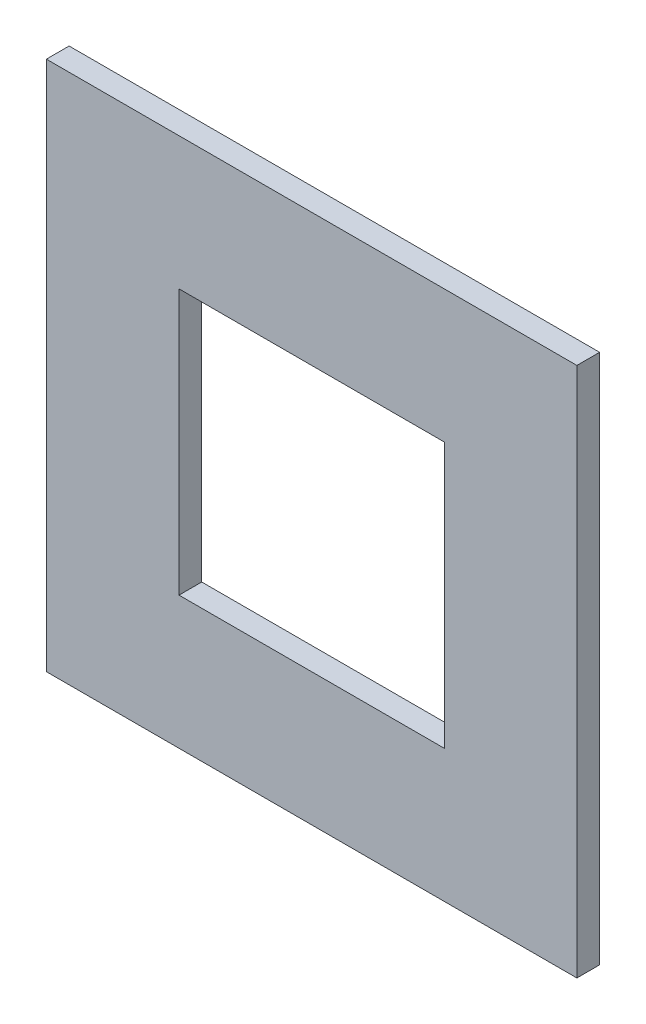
ISO-10303-21;
HEADER;
FILE_DESCRIPTION(('STEP AP214'),'2;1');
FILE_NAME('part.step','',(''),(''),'','','');
FILE_SCHEMA(('AUTOMOTIVE_DESIGN { 1 0 10303 214 1 1 1 1 }'));
ENDSEC;
DATA;
#1=APPLICATION_CONTEXT('core data for automotive mechanical design processes');
#2=APPLICATION_PROTOCOL_DEFINITION('international standard','automotive_design',2000,#1);
#3=PRODUCT_CONTEXT('',#1,'mechanical');
#4=PRODUCT('Part','Part','',(#3));
#5=PRODUCT_RELATED_PRODUCT_CATEGORY('part','',(#4));
#6=PRODUCT_DEFINITION_FORMATION('','',#4);
#7=PRODUCT_DEFINITION_CONTEXT('part definition',#1,'design');
#8=PRODUCT_DEFINITION('design','',#6,#7);
#9=PRODUCT_DEFINITION_SHAPE('','',#8);
#10=(LENGTH_UNIT() NAMED_UNIT(*) SI_UNIT(.MILLI.,.METRE.));
#11=(NAMED_UNIT(*) PLANE_ANGLE_UNIT() SI_UNIT($,.RADIAN.));
#12=(NAMED_UNIT(*) SI_UNIT($,.STERADIAN.) SOLID_ANGLE_UNIT());
#13=UNCERTAINTY_MEASURE_WITH_UNIT(LENGTH_MEASURE(1.E-05),#10,'distance_accuracy_value','');
#14=(GEOMETRIC_REPRESENTATION_CONTEXT(3) GLOBAL_UNCERTAINTY_ASSIGNED_CONTEXT((#13)) GLOBAL_UNIT_ASSIGNED_CONTEXT((#10,
#11,#12)) REPRESENTATION_CONTEXT('',''));
#15=CARTESIAN_POINT('',(0.,0.,0.));
#16=DIRECTION('',(0.,0.,1.));
#17=DIRECTION('',(1.,0.,0.));
#18=AXIS2_PLACEMENT_3D('',#15,#16,#17);
#19=CARTESIAN_POINT('',(0.,0.,3.));
#20=DIRECTION('',(0.,0.,1.));
#21=DIRECTION('',(1.,0.,0.));
#22=AXIS2_PLACEMENT_3D('',#19,#20,#21);
#23=PLANE('',#22);
#24=DIRECTION('',(0.,1.,0.));
#25=VECTOR('',#24,1.);
#26=CARTESIAN_POINT('',(35.,35.,3.));
#27=LINE('',#26,#25);
#28=CARTESIAN_POINT('',(35.,-35.,3.));
#29=VERTEX_POINT('',#28);
#30=CARTESIAN_POINT('',(35.,35.,3.));
#31=VERTEX_POINT('',#30);
#32=EDGE_CURVE('E133',#29,#31,#27,.T.);
#33=ORIENTED_EDGE('',*,*,#32,.T.);
#34=DIRECTION('',(-1.,0.,0.));
#35=VECTOR('',#34,1.);
#36=CARTESIAN_POINT('',(-35.,35.,3.));
#37=LINE('',#36,#35);
#38=CARTESIAN_POINT('',(-35.,35.,3.));
#39=VERTEX_POINT('',#38);
#40=EDGE_CURVE('E136',#31,#39,#37,.T.);
#41=ORIENTED_EDGE('',*,*,#40,.T.);
#42=DIRECTION('',(0.,-1.,0.));
#43=VECTOR('',#42,1.);
#44=CARTESIAN_POINT('',(-35.,35.,3.));
#45=LINE('',#44,#43);
#46=CARTESIAN_POINT('',(-35.,-35.,3.));
#47=VERTEX_POINT('',#46);
#48=EDGE_CURVE('E139',#39,#47,#45,.T.);
#49=ORIENTED_EDGE('',*,*,#48,.T.);
#50=DIRECTION('',(1.,0.,0.));
#51=VECTOR('',#50,1.);
#52=CARTESIAN_POINT('',(-35.,-35.,3.));
#53=LINE('',#52,#51);
#54=EDGE_CURVE('E141',#47,#29,#53,.T.);
#55=ORIENTED_EDGE('',*,*,#54,.T.);
#56=EDGE_LOOP('',(#33,#41,#49,#55));
#57=FACE_BOUND('',#56,.T.);
#58=DIRECTION('',(-1.,0.,0.));
#59=VECTOR('',#58,1.);
#60=CARTESIAN_POINT('',(-17.5,17.5,3.));
#61=LINE('',#60,#59);
#62=CARTESIAN_POINT('',(17.5,17.5,3.));
#63=VERTEX_POINT('',#62);
#64=CARTESIAN_POINT('',(-17.5,17.5,3.));
#65=VERTEX_POINT('',#64);
#66=EDGE_CURVE('E105',#63,#65,#61,.T.);
#67=ORIENTED_EDGE('',*,*,#66,.F.);
#68=DIRECTION('',(0.,1.,0.));
#69=VECTOR('',#68,1.);
#70=CARTESIAN_POINT('',(17.5,17.5,3.));
#71=LINE('',#70,#69);
#72=CARTESIAN_POINT('',(17.5,-17.5,3.));
#73=VERTEX_POINT('',#72);
#74=EDGE_CURVE('E97',#73,#63,#71,.T.);
#75=ORIENTED_EDGE('',*,*,#74,.F.);
#76=DIRECTION('',(1.,0.,0.));
#77=VECTOR('',#76,1.);
#78=CARTESIAN_POINT('',(-17.5,-17.5,3.));
#79=LINE('',#78,#77);
#80=CARTESIAN_POINT('',(-17.5,-17.5,3.));
#81=VERTEX_POINT('',#80);
#82=EDGE_CURVE('E119',#81,#73,#79,.T.);
#83=ORIENTED_EDGE('',*,*,#82,.F.);
#84=DIRECTION('',(0.,-1.,0.));
#85=VECTOR('',#84,1.);
#86=CARTESIAN_POINT('',(-17.5,17.5,3.));
#87=LINE('',#86,#85);
#88=EDGE_CURVE('E117',#65,#81,#87,.T.);
#89=ORIENTED_EDGE('',*,*,#88,.F.);
#90=EDGE_LOOP('',(#67,#75,#83,#89));
#91=FACE_BOUND('',#90,.T.);
#92=ADVANCED_FACE('F32',(#57,#91),#23,.T.);
#93=CARTESIAN_POINT('',(0.,0.,0.));
#94=DIRECTION('',(0.,0.,1.));
#95=DIRECTION('',(1.,0.,0.));
#96=AXIS2_PLACEMENT_3D('',#93,#94,#95);
#97=PLANE('',#96);
#98=DIRECTION('',(0.,1.,0.));
#99=VECTOR('',#98,1.);
#100=CARTESIAN_POINT('',(35.,35.,0.));
#101=LINE('',#100,#99);
#102=CARTESIAN_POINT('',(35.,-35.,0.));
#103=VERTEX_POINT('',#102);
#104=CARTESIAN_POINT('',(35.,35.,0.));
#105=VERTEX_POINT('',#104);
#106=EDGE_CURVE('E113',#103,#105,#101,.T.);
#107=ORIENTED_EDGE('',*,*,#106,.F.);
#108=DIRECTION('',(1.,0.,0.));
#109=VECTOR('',#108,1.);
#110=CARTESIAN_POINT('',(-35.,-35.,0.));
#111=LINE('',#110,#109);
#112=CARTESIAN_POINT('',(-35.,-35.,0.));
#113=VERTEX_POINT('',#112);
#114=EDGE_CURVE('E137',#113,#103,#111,.T.);
#115=ORIENTED_EDGE('',*,*,#114,.F.);
#116=DIRECTION('',(0.,-1.,0.));
#117=VECTOR('',#116,1.);
#118=CARTESIAN_POINT('',(-35.,35.,0.));
#119=LINE('',#118,#117);
#120=CARTESIAN_POINT('',(-35.,35.,0.));
#121=VERTEX_POINT('',#120);
#122=EDGE_CURVE('E148',#121,#113,#119,.T.);
#123=ORIENTED_EDGE('',*,*,#122,.F.);
#124=DIRECTION('',(-1.,0.,0.));
#125=VECTOR('',#124,1.);
#126=CARTESIAN_POINT('',(-35.,35.,0.));
#127=LINE('',#126,#125);
#128=EDGE_CURVE('E146',#105,#121,#127,.T.);
#129=ORIENTED_EDGE('',*,*,#128,.F.);
#130=EDGE_LOOP('',(#107,#115,#123,#129));
#131=FACE_BOUND('',#130,.T.);
#132=DIRECTION('',(0.,1.,0.));
#133=VECTOR('',#132,1.);
#134=CARTESIAN_POINT('',(17.5,17.5,0.));
#135=LINE('',#134,#133);
#136=CARTESIAN_POINT('',(17.5,-17.5,0.));
#137=VERTEX_POINT('',#136);
#138=CARTESIAN_POINT('',(17.5,17.5,0.));
#139=VERTEX_POINT('',#138);
#140=EDGE_CURVE('E55',#137,#139,#135,.T.);
#141=ORIENTED_EDGE('',*,*,#140,.T.);
#142=DIRECTION('',(-1.,0.,0.));
#143=VECTOR('',#142,1.);
#144=CARTESIAN_POINT('',(-17.5,17.5,0.));
#145=LINE('',#144,#143);
#146=CARTESIAN_POINT('',(-17.5,17.5,0.));
#147=VERTEX_POINT('',#146);
#148=EDGE_CURVE('E112',#139,#147,#145,.T.);
#149=ORIENTED_EDGE('',*,*,#148,.T.);
#150=DIRECTION('',(0.,-1.,0.));
#151=VECTOR('',#150,1.);
#152=CARTESIAN_POINT('',(-17.5,17.5,0.));
#153=LINE('',#152,#151);
#154=CARTESIAN_POINT('',(-17.5,-17.5,0.));
#155=VERTEX_POINT('',#154);
#156=EDGE_CURVE('E125',#147,#155,#153,.T.);
#157=ORIENTED_EDGE('',*,*,#156,.T.);
#158=DIRECTION('',(1.,0.,0.));
#159=VECTOR('',#158,1.);
#160=CARTESIAN_POINT('',(-17.5,-17.5,0.));
#161=LINE('',#160,#159);
#162=EDGE_CURVE('E106',#155,#137,#161,.T.);
#163=ORIENTED_EDGE('',*,*,#162,.T.);
#164=EDGE_LOOP('',(#141,#149,#157,#163));
#165=FACE_BOUND('',#164,.T.);
#166=ADVANCED_FACE('F166',(#131,#165),#97,.F.);
#167=CARTESIAN_POINT('',(35.,35.,3.));
#168=DIRECTION('',(-1.,0.,0.));
#169=DIRECTION('',(0.,-1.,0.));
#170=AXIS2_PLACEMENT_3D('',#167,#168,#169);
#171=PLANE('',#170);
#172=ORIENTED_EDGE('',*,*,#106,.T.);
#173=DIRECTION('',(0.,0.,-1.));
#174=VECTOR('',#173,1.);
#175=CARTESIAN_POINT('',(35.,35.,3.));
#176=LINE('',#175,#174);
#177=EDGE_CURVE('E11',#31,#105,#176,.T.);
#178=ORIENTED_EDGE('',*,*,#177,.F.);
#179=ORIENTED_EDGE('',*,*,#32,.F.);
#180=DIRECTION('',(0.,0.,-1.));
#181=VECTOR('',#180,1.);
#182=CARTESIAN_POINT('',(35.,-35.,3.));
#183=LINE('',#182,#181);
#184=EDGE_CURVE('E143',#29,#103,#183,.T.);
#185=ORIENTED_EDGE('',*,*,#184,.T.);
#186=EDGE_LOOP('',(#172,#178,#179,#185));
#187=FACE_BOUND('',#186,.T.);
#188=ADVANCED_FACE('F34',(#187),#171,.F.);
#189=CARTESIAN_POINT('',(-35.,35.,3.));
#190=DIRECTION('',(0.,-1.,0.));
#191=DIRECTION('',(0.,0.,-1.));
#192=AXIS2_PLACEMENT_3D('',#189,#190,#191);
#193=PLANE('',#192);
#194=ORIENTED_EDGE('',*,*,#128,.T.);
#195=DIRECTION('',(0.,0.,-1.));
#196=VECTOR('',#195,1.);
#197=CARTESIAN_POINT('',(-35.,35.,3.));
#198=LINE('',#197,#196);
#199=EDGE_CURVE('E40',#39,#121,#198,.T.);
#200=ORIENTED_EDGE('',*,*,#199,.F.);
#201=ORIENTED_EDGE('',*,*,#40,.F.);
#202=ORIENTED_EDGE('',*,*,#177,.T.);
#203=EDGE_LOOP('',(#194,#200,#201,#202));
#204=FACE_BOUND('',#203,.T.);
#205=ADVANCED_FACE('F176',(#204),#193,.F.);
#206=CARTESIAN_POINT('',(-35.,35.,3.));
#207=DIRECTION('',(1.,0.,0.));
#208=DIRECTION('',(0.,1.,0.));
#209=AXIS2_PLACEMENT_3D('',#206,#207,#208);
#210=PLANE('',#209);
#211=ORIENTED_EDGE('',*,*,#122,.T.);
#212=DIRECTION('',(0.,0.,-1.));
#213=VECTOR('',#212,1.);
#214=CARTESIAN_POINT('',(-35.,-35.,3.));
#215=LINE('',#214,#213);
#216=EDGE_CURVE('E153',#47,#113,#215,.T.);
#217=ORIENTED_EDGE('',*,*,#216,.F.);
#218=ORIENTED_EDGE('',*,*,#48,.F.);
#219=ORIENTED_EDGE('',*,*,#199,.T.);
#220=EDGE_LOOP('',(#211,#217,#218,#219));
#221=FACE_BOUND('',#220,.T.);
#222=ADVANCED_FACE('F160',(#221),#210,.F.);
#223=CARTESIAN_POINT('',(-35.,-35.,3.));
#224=DIRECTION('',(0.,1.,0.));
#225=DIRECTION('',(0.,0.,1.));
#226=AXIS2_PLACEMENT_3D('',#223,#224,#225);
#227=PLANE('',#226);
#228=ORIENTED_EDGE('',*,*,#114,.T.);
#229=ORIENTED_EDGE('',*,*,#184,.F.);
#230=ORIENTED_EDGE('',*,*,#54,.F.);
#231=ORIENTED_EDGE('',*,*,#216,.T.);
#232=EDGE_LOOP('',(#228,#229,#230,#231));
#233=FACE_BOUND('',#232,.T.);
#234=ADVANCED_FACE('F170',(#233),#227,.F.);
#235=CARTESIAN_POINT('',(17.5,17.5,3.));
#236=DIRECTION('',(-1.,0.,0.));
#237=DIRECTION('',(0.,-1.,0.));
#238=AXIS2_PLACEMENT_3D('',#235,#236,#237);
#239=PLANE('',#238);
#240=ORIENTED_EDGE('',*,*,#140,.F.);
#241=DIRECTION('',(0.,0.,-1.));
#242=VECTOR('',#241,1.);
#243=CARTESIAN_POINT('',(17.5,-17.5,3.));
#244=LINE('',#243,#242);
#245=EDGE_CURVE('E101',#73,#137,#244,.T.);
#246=ORIENTED_EDGE('',*,*,#245,.F.);
#247=ORIENTED_EDGE('',*,*,#74,.T.);
#248=DIRECTION('',(0.,0.,-1.));
#249=VECTOR('',#248,1.);
#250=CARTESIAN_POINT('',(17.5,17.5,3.));
#251=LINE('',#250,#249);
#252=EDGE_CURVE('E100',#63,#139,#251,.T.);
#253=ORIENTED_EDGE('',*,*,#252,.T.);
#254=EDGE_LOOP('',(#240,#246,#247,#253));
#255=FACE_BOUND('',#254,.T.);
#256=ADVANCED_FACE('F99',(#255),#239,.T.);
#257=CARTESIAN_POINT('',(-17.5,17.5,3.));
#258=DIRECTION('',(0.,-1.,0.));
#259=DIRECTION('',(0.,0.,-1.));
#260=AXIS2_PLACEMENT_3D('',#257,#258,#259);
#261=PLANE('',#260);
#262=ORIENTED_EDGE('',*,*,#148,.F.);
#263=ORIENTED_EDGE('',*,*,#252,.F.);
#264=ORIENTED_EDGE('',*,*,#66,.T.);
#265=DIRECTION('',(0.,0.,-1.));
#266=VECTOR('',#265,1.);
#267=CARTESIAN_POINT('',(-17.5,17.5,3.));
#268=LINE('',#267,#266);
#269=EDGE_CURVE('E114',#65,#147,#268,.T.);
#270=ORIENTED_EDGE('',*,*,#269,.T.);
#271=EDGE_LOOP('',(#262,#263,#264,#270));
#272=FACE_BOUND('',#271,.T.);
#273=ADVANCED_FACE('F109',(#272),#261,.T.);
#274=CARTESIAN_POINT('',(-17.5,17.5,3.));
#275=DIRECTION('',(1.,0.,0.));
#276=DIRECTION('',(0.,0.,-1.));
#277=AXIS2_PLACEMENT_3D('',#274,#275,#276);
#278=PLANE('',#277);
#279=ORIENTED_EDGE('',*,*,#156,.F.);
#280=ORIENTED_EDGE('',*,*,#269,.F.);
#281=ORIENTED_EDGE('',*,*,#88,.T.);
#282=DIRECTION('',(0.,0.,-1.));
#283=VECTOR('',#282,1.);
#284=CARTESIAN_POINT('',(-17.5,-17.5,3.));
#285=LINE('',#284,#283);
#286=EDGE_CURVE('E47',#81,#155,#285,.T.);
#287=ORIENTED_EDGE('',*,*,#286,.T.);
#288=EDGE_LOOP('',(#279,#280,#281,#287));
#289=FACE_BOUND('',#288,.T.);
#290=ADVANCED_FACE('F199',(#289),#278,.T.);
#291=CARTESIAN_POINT('',(-17.5,-17.5,3.));
#292=DIRECTION('',(0.,1.,0.));
#293=DIRECTION('',(0.,0.,1.));
#294=AXIS2_PLACEMENT_3D('',#291,#292,#293);
#295=PLANE('',#294);
#296=ORIENTED_EDGE('',*,*,#162,.F.);
#297=ORIENTED_EDGE('',*,*,#286,.F.);
#298=ORIENTED_EDGE('',*,*,#82,.T.);
#299=ORIENTED_EDGE('',*,*,#245,.T.);
#300=EDGE_LOOP('',(#296,#297,#298,#299));
#301=FACE_BOUND('',#300,.T.);
#302=ADVANCED_FACE('F203',(#301),#295,.T.);
#303=CLOSED_SHELL('',(#92,#166,#188,#205,#222,#234,#256,#273,#290,#302));
#304=MANIFOLD_SOLID_BREP('B2',#303);
#305=ADVANCED_BREP_SHAPE_REPRESENTATION('',(#18,#304),#14);
#306=SHAPE_DEFINITION_REPRESENTATION(#9,#305);
ENDSEC;
END-ISO-10303-21;
